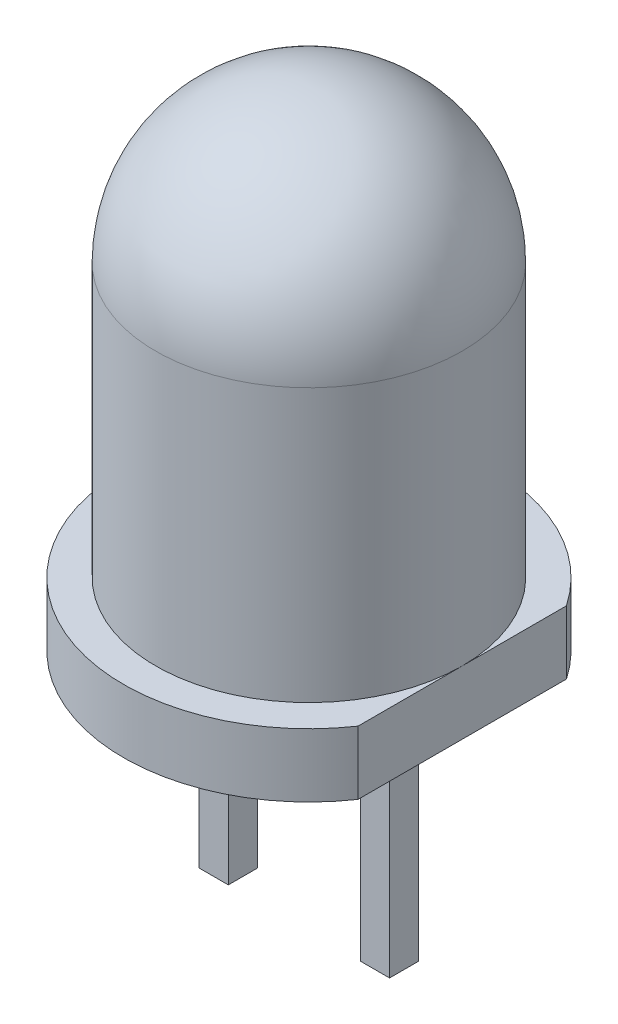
ISO-10303-21;
HEADER;
FILE_DESCRIPTION(('STEP AP214'),'2;1');
FILE_NAME('part.step','',(''),(''),'','','');
FILE_SCHEMA(('AUTOMOTIVE_DESIGN { 1 0 10303 214 1 1 1 1 }'));
ENDSEC;
DATA;
#1=APPLICATION_CONTEXT('core data for automotive mechanical design processes');
#2=APPLICATION_PROTOCOL_DEFINITION('international standard','automotive_design',2000,#1);
#3=PRODUCT_CONTEXT('',#1,'mechanical');
#4=PRODUCT('Part','Part','',(#3));
#5=PRODUCT_RELATED_PRODUCT_CATEGORY('part','',(#4));
#6=PRODUCT_DEFINITION_FORMATION('','',#4);
#7=PRODUCT_DEFINITION_CONTEXT('part definition',#1,'design');
#8=PRODUCT_DEFINITION('design','',#6,#7);
#9=PRODUCT_DEFINITION_SHAPE('','',#8);
#10=(LENGTH_UNIT() NAMED_UNIT(*) SI_UNIT(.MILLI.,.METRE.));
#11=(NAMED_UNIT(*) PLANE_ANGLE_UNIT() SI_UNIT($,.RADIAN.));
#12=(NAMED_UNIT(*) SI_UNIT($,.STERADIAN.) SOLID_ANGLE_UNIT());
#13=UNCERTAINTY_MEASURE_WITH_UNIT(LENGTH_MEASURE(1.E-05),#10,'distance_accuracy_value','');
#14=(GEOMETRIC_REPRESENTATION_CONTEXT(3) GLOBAL_UNCERTAINTY_ASSIGNED_CONTEXT((#13)) GLOBAL_UNIT_ASSIGNED_CONTEXT((#10,
#11,#12)) REPRESENTATION_CONTEXT('',''));
#15=CARTESIAN_POINT('',(0.,0.,0.));
#16=DIRECTION('',(0.,0.,1.));
#17=DIRECTION('',(1.,0.,0.));
#18=AXIS2_PLACEMENT_3D('',#15,#16,#17);
#19=CARTESIAN_POINT('',(0.,0.999999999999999,0.));
#20=DIRECTION('',(0.,1.,0.));
#21=DIRECTION('',(-1.,0.,0.));
#22=AXIS2_PLACEMENT_3D('',#19,#20,#21);
#23=PLANE('',#22);
#24=DIRECTION('',(0.,0.,-1.));
#25=VECTOR('',#24,1.);
#26=CARTESIAN_POINT('',(0.239999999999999,1.,0.23));
#27=LINE('',#26,#25);
#28=CARTESIAN_POINT('',(0.239999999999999,1.,-1.03));
#29=VERTEX_POINT('',#28);
#30=CARTESIAN_POINT('',(0.239999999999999,1.,1.03));
#31=VERTEX_POINT('',#30);
#32=EDGE_CURVE('E197',#29,#31,#27,.F.);
#33=ORIENTED_EDGE('',*,*,#32,.T.);
#34=DIRECTION('',(-1.,0.,0.));
#35=VECTOR('',#34,1.);
#36=CARTESIAN_POINT('',(1.5,1.,1.03));
#37=LINE('',#36,#35);
#38=CARTESIAN_POINT('',(2.3,1.,1.03));
#39=VERTEX_POINT('',#38);
#40=EDGE_CURVE('E206',#31,#39,#37,.F.);
#41=ORIENTED_EDGE('',*,*,#40,.T.);
#42=DIRECTION('',(0.,0.,1.));
#43=VECTOR('',#42,1.);
#44=CARTESIAN_POINT('',(2.3,1.,-0.23));
#45=LINE('',#44,#43);
#46=CARTESIAN_POINT('',(2.3,1.,-1.03));
#47=VERTEX_POINT('',#46);
#48=EDGE_CURVE('E203',#39,#47,#45,.F.);
#49=ORIENTED_EDGE('',*,*,#48,.T.);
#50=DIRECTION('',(1.,0.,0.));
#51=VECTOR('',#50,1.);
#52=CARTESIAN_POINT('',(1.04,1.,-1.03));
#53=LINE('',#52,#51);
#54=EDGE_CURVE('E200',#47,#29,#53,.F.);
#55=ORIENTED_EDGE('',*,*,#54,.T.);
#56=EDGE_LOOP('',(#33,#41,#49,#55));
#57=FACE_BOUND('',#56,.T.);
#58=DIRECTION('',(0.,0.,1.));
#59=VECTOR('',#58,1.);
#60=CARTESIAN_POINT('',(-0.240000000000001,0.999999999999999,-0.23));
#61=LINE('',#60,#59);
#62=CARTESIAN_POINT('',(-0.240000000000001,0.999999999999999,1.03));
#63=VERTEX_POINT('',#62);
#64=CARTESIAN_POINT('',(-0.240000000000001,0.999999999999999,-1.03));
#65=VERTEX_POINT('',#64);
#66=EDGE_CURVE('E184',#63,#65,#61,.F.);
#67=ORIENTED_EDGE('',*,*,#66,.T.);
#68=DIRECTION('',(1.,0.,0.));
#69=VECTOR('',#68,1.);
#70=CARTESIAN_POINT('',(-1.5,0.999999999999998,-1.03));
#71=LINE('',#70,#69);
#72=CARTESIAN_POINT('',(-2.3,0.999999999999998,-1.03));
#73=VERTEX_POINT('',#72);
#74=EDGE_CURVE('E193',#65,#73,#71,.F.);
#75=ORIENTED_EDGE('',*,*,#74,.T.);
#76=DIRECTION('',(0.,0.,-1.));
#77=VECTOR('',#76,1.);
#78=CARTESIAN_POINT('',(-2.3,0.999999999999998,0.23));
#79=LINE('',#78,#77);
#80=CARTESIAN_POINT('',(-2.3,0.999999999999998,1.03));
#81=VERTEX_POINT('',#80);
#82=EDGE_CURVE('E190',#73,#81,#79,.F.);
#83=ORIENTED_EDGE('',*,*,#82,.T.);
#84=DIRECTION('',(-1.,0.,0.));
#85=VECTOR('',#84,1.);
#86=CARTESIAN_POINT('',(-1.04,0.999999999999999,1.03));
#87=LINE('',#86,#85);
#88=EDGE_CURVE('E187',#81,#63,#87,.F.);
#89=ORIENTED_EDGE('',*,*,#88,.T.);
#90=EDGE_LOOP('',(#67,#75,#83,#89));
#91=FACE_BOUND('',#90,.T.);
#92=DIRECTION('',(0.,0.,-1.));
#93=VECTOR('',#92,1.);
#94=CARTESIAN_POINT('',(2.415,1.,0.));
#95=LINE('',#94,#93);
#96=CARTESIAN_POINT('',(2.415,1.,1.64139422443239));
#97=VERTEX_POINT('',#96);
#98=CARTESIAN_POINT('',(2.415,1.,-1.64139422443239));
#99=VERTEX_POINT('',#98);
#100=EDGE_CURVE('E149',#97,#99,#95,.T.);
#101=ORIENTED_EDGE('',*,*,#100,.F.);
#102=CARTESIAN_POINT('',(0.,0.999999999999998,0.));
#103=DIRECTION('',(0.,1.,0.));
#104=DIRECTION('',(-1.,0.,0.));
#105=AXIS2_PLACEMENT_3D('',#102,#103,#104);
#106=CIRCLE('',#105,2.92);
#107=EDGE_CURVE('E170',#99,#97,#106,.T.);
#108=ORIENTED_EDGE('',*,*,#107,.F.);
#109=EDGE_LOOP('',(#101,#108));
#110=FACE_BOUND('',#109,.T.);
#111=ADVANCED_FACE('F37',(#57,#91,#110),#23,.F.);
#112=CARTESIAN_POINT('',(0.,8.71,0.));
#113=DIRECTION('',(0.,1.,0.));
#114=DIRECTION('',(-1.,0.,0.));
#115=AXIS2_PLACEMENT_3D('',#112,#113,#114);
#116=CYLINDRICAL_SURFACE('',#115,2.92);
#117=DIRECTION('',(0.,-1.,0.));
#118=VECTOR('',#117,1.);
#119=CARTESIAN_POINT('',(2.415,5.32140407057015,-1.64139422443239));
#120=LINE('',#119,#118);
#121=CARTESIAN_POINT('',(2.415,2.,-1.64139422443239));
#122=VERTEX_POINT('',#121);
#123=EDGE_CURVE('E143',#122,#99,#120,.T.);
#124=ORIENTED_EDGE('',*,*,#123,.T.);
#125=ORIENTED_EDGE('',*,*,#107,.T.);
#126=DIRECTION('',(0.,-1.,0.));
#127=VECTOR('',#126,1.);
#128=CARTESIAN_POINT('',(2.415,5.32140407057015,1.64139422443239));
#129=LINE('',#128,#127);
#130=CARTESIAN_POINT('',(2.415,2.,1.64139422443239));
#131=VERTEX_POINT('',#130);
#132=EDGE_CURVE('E155',#131,#97,#129,.T.);
#133=ORIENTED_EDGE('',*,*,#132,.F.);
#134=CARTESIAN_POINT('',(0.,2.,0.));
#135=DIRECTION('',(0.,1.,0.));
#136=DIRECTION('',(-1.,0.,0.));
#137=AXIS2_PLACEMENT_3D('',#134,#135,#136);
#138=CIRCLE('',#137,2.92);
#139=EDGE_CURVE('E161',#122,#131,#138,.T.);
#140=ORIENTED_EDGE('',*,*,#139,.F.);
#141=EDGE_LOOP('',(#124,#125,#133,#140));
#142=FACE_BOUND('',#141,.T.);
#143=ADVANCED_FACE('F168',(#142),#116,.T.);
#144=CARTESIAN_POINT('',(2.92,2.,0.));
#145=DIRECTION('',(0.,-1.,0.));
#146=DIRECTION('',(1.,0.,0.));
#147=AXIS2_PLACEMENT_3D('',#144,#145,#146);
#148=PLANE('',#147);
#149=DIRECTION('',(0.,0.,-1.));
#150=VECTOR('',#149,1.);
#151=CARTESIAN_POINT('',(2.415,2.,-1.64139422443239));
#152=LINE('',#151,#150);
#153=CARTESIAN_POINT('',(2.415,2.,0.));
#154=VERTEX_POINT('',#153);
#155=EDGE_CURVE('E146',#154,#122,#152,.T.);
#156=ORIENTED_EDGE('',*,*,#155,.T.);
#157=ORIENTED_EDGE('',*,*,#139,.T.);
#158=EDGE_CURVE('E165',#131,#154,#152,.T.);
#159=ORIENTED_EDGE('',*,*,#158,.T.);
#160=CARTESIAN_POINT('',(0.,2.,0.));
#161=DIRECTION('',(0.,1.,0.));
#162=DIRECTION('',(-1.,0.,0.));
#163=AXIS2_PLACEMENT_3D('',#160,#161,#162);
#164=CIRCLE('',#163,2.415);
#165=EDGE_CURVE('E163',#154,#154,#164,.T.);
#166=ORIENTED_EDGE('',*,*,#165,.F.);
#167=EDGE_LOOP('',(#156,#157,#159,#166));
#168=FACE_BOUND('',#167,.T.);
#169=ADVANCED_FACE('F160',(#168),#148,.F.);
#170=CARTESIAN_POINT('',(0.,8.71,0.));
#171=DIRECTION('',(0.,1.,0.));
#172=DIRECTION('',(-1.,0.,0.));
#173=AXIS2_PLACEMENT_3D('',#170,#171,#172);
#174=CYLINDRICAL_SURFACE('',#173,2.415);
#175=CARTESIAN_POINT('',(0.,6.295,0.));
#176=DIRECTION('',(0.,1.,0.));
#177=DIRECTION('',(-1.,0.,0.));
#178=AXIS2_PLACEMENT_3D('',#175,#176,#177);
#179=CIRCLE('',#178,2.415);
#180=CARTESIAN_POINT('',(-2.415,6.29499999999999,0.));
#181=VERTEX_POINT('',#180);
#182=EDGE_CURVE('E177',#181,#181,#179,.T.);
#183=ORIENTED_EDGE('',*,*,#182,.F.);
#184=EDGE_LOOP('',(#183));
#185=FACE_BOUND('',#184,.T.);
#186=ORIENTED_EDGE('',*,*,#165,.T.);
#187=EDGE_LOOP('',(#186));
#188=FACE_BOUND('',#187,.T.);
#189=ADVANCED_FACE('F297',(#185,#188),#174,.T.);
#190=CARTESIAN_POINT('',(0.,6.295,0.));
#191=DIRECTION('',(0.,1.,0.));
#192=DIRECTION('',(1.,0.,0.));
#193=AXIS2_PLACEMENT_3D('',#190,#191,#192);
#194=SPHERICAL_SURFACE('',#193,2.415);
#195=ORIENTED_EDGE('',*,*,#182,.T.);
#196=EDGE_LOOP('',(#195));
#197=FACE_BOUND('',#196,.T.);
#198=ADVANCED_FACE('F295',(#197),#194,.T.);
#199=CARTESIAN_POINT('',(-1.5,-2.6,0.23));
#200=DIRECTION('',(1.,0.,0.));
#201=DIRECTION('',(0.,1.,0.));
#202=AXIS2_PLACEMENT_3D('',#199,#200,#201);
#203=PLANE('',#202);
#204=DIRECTION('',(0.,1.,0.));
#205=VECTOR('',#204,1.);
#206=CARTESIAN_POINT('',(-1.5,-2.6,0.23));
#207=LINE('',#206,#205);
#208=CARTESIAN_POINT('',(-1.5,-2.6,0.23));
#209=VERTEX_POINT('',#208);
#210=CARTESIAN_POINT('',(-1.5,0.199999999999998,0.23));
#211=VERTEX_POINT('',#210);
#212=EDGE_CURVE('E289',#209,#211,#207,.T.);
#213=ORIENTED_EDGE('',*,*,#212,.T.);
#214=DIRECTION('',(0.,0.,-1.));
#215=VECTOR('',#214,1.);
#216=CARTESIAN_POINT('',(-1.5,0.199999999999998,-0.23));
#217=LINE('',#216,#215);
#218=CARTESIAN_POINT('',(-1.5,0.199999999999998,-0.23));
#219=VERTEX_POINT('',#218);
#220=EDGE_CURVE('E223',#211,#219,#217,.T.);
#221=ORIENTED_EDGE('',*,*,#220,.T.);
#222=DIRECTION('',(0.,1.,0.));
#223=VECTOR('',#222,1.);
#224=CARTESIAN_POINT('',(-1.5,-2.6,-0.23));
#225=LINE('',#224,#223);
#226=CARTESIAN_POINT('',(-1.5,-2.6,-0.23));
#227=VERTEX_POINT('',#226);
#228=EDGE_CURVE('E279',#227,#219,#225,.T.);
#229=ORIENTED_EDGE('',*,*,#228,.F.);
#230=DIRECTION('',(0.,0.,-1.));
#231=VECTOR('',#230,1.);
#232=CARTESIAN_POINT('',(-1.5,-2.6,0.23));
#233=LINE('',#232,#231);
#234=EDGE_CURVE('E539',#209,#227,#233,.T.);
#235=ORIENTED_EDGE('',*,*,#234,.F.);
#236=EDGE_LOOP('',(#213,#221,#229,#235));
#237=FACE_BOUND('',#236,.T.);
#238=ADVANCED_FACE('F305',(#237),#203,.F.);
#239=CARTESIAN_POINT('',(-1.5,-2.6,-0.23));
#240=DIRECTION('',(0.,0.,1.));
#241=DIRECTION('',(1.,0.,0.));
#242=AXIS2_PLACEMENT_3D('',#239,#240,#241);
#243=PLANE('',#242);
#244=ORIENTED_EDGE('',*,*,#228,.T.);
#245=DIRECTION('',(1.,0.,0.));
#246=VECTOR('',#245,1.);
#247=CARTESIAN_POINT('',(-1.04,0.199999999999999,-0.23));
#248=LINE('',#247,#246);
#249=CARTESIAN_POINT('',(-1.04,0.199999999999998,-0.23));
#250=VERTEX_POINT('',#249);
#251=EDGE_CURVE('E219',#219,#250,#248,.T.);
#252=ORIENTED_EDGE('',*,*,#251,.T.);
#253=DIRECTION('',(0.,1.,0.));
#254=VECTOR('',#253,1.);
#255=CARTESIAN_POINT('',(-1.04,-2.6,-0.23));
#256=LINE('',#255,#254);
#257=CARTESIAN_POINT('',(-1.04,-2.6,-0.23));
#258=VERTEX_POINT('',#257);
#259=EDGE_CURVE('E276',#258,#250,#256,.T.);
#260=ORIENTED_EDGE('',*,*,#259,.F.);
#261=DIRECTION('',(1.,0.,0.));
#262=VECTOR('',#261,1.);
#263=CARTESIAN_POINT('',(-1.5,-2.6,-0.23));
#264=LINE('',#263,#262);
#265=EDGE_CURVE('E549',#227,#258,#264,.T.);
#266=ORIENTED_EDGE('',*,*,#265,.F.);
#267=EDGE_LOOP('',(#244,#252,#260,#266));
#268=FACE_BOUND('',#267,.T.);
#269=ADVANCED_FACE('F275',(#268),#243,.F.);
#270=CARTESIAN_POINT('',(-1.04,-2.6,0.23));
#271=DIRECTION('',(-1.,0.,0.));
#272=DIRECTION('',(0.,-1.,0.));
#273=AXIS2_PLACEMENT_3D('',#270,#271,#272);
#274=PLANE('',#273);
#275=ORIENTED_EDGE('',*,*,#259,.T.);
#276=DIRECTION('',(0.,0.,1.));
#277=VECTOR('',#276,1.);
#278=CARTESIAN_POINT('',(-1.04,0.199999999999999,0.23));
#279=LINE('',#278,#277);
#280=CARTESIAN_POINT('',(-1.04,0.199999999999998,0.23));
#281=VERTEX_POINT('',#280);
#282=EDGE_CURVE('E11',#250,#281,#279,.T.);
#283=ORIENTED_EDGE('',*,*,#282,.T.);
#284=DIRECTION('',(0.,1.,0.));
#285=VECTOR('',#284,1.);
#286=CARTESIAN_POINT('',(-1.04,-2.6,0.23));
#287=LINE('',#286,#285);
#288=CARTESIAN_POINT('',(-1.04,-2.6,0.23));
#289=VERTEX_POINT('',#288);
#290=EDGE_CURVE('E283',#289,#281,#287,.T.);
#291=ORIENTED_EDGE('',*,*,#290,.F.);
#292=DIRECTION('',(0.,0.,1.));
#293=VECTOR('',#292,1.);
#294=CARTESIAN_POINT('',(-1.04,-2.6,0.23));
#295=LINE('',#294,#293);
#296=EDGE_CURVE('E281',#258,#289,#295,.T.);
#297=ORIENTED_EDGE('',*,*,#296,.F.);
#298=EDGE_LOOP('',(#275,#283,#291,#297));
#299=FACE_BOUND('',#298,.T.);
#300=ADVANCED_FACE('F280',(#299),#274,.F.);
#301=CARTESIAN_POINT('',(-1.5,-2.6,0.23));
#302=DIRECTION('',(0.,0.,-1.));
#303=DIRECTION('',(-1.,0.,0.));
#304=AXIS2_PLACEMENT_3D('',#301,#302,#303);
#305=PLANE('',#304);
#306=ORIENTED_EDGE('',*,*,#290,.T.);
#307=DIRECTION('',(-1.,0.,0.));
#308=VECTOR('',#307,1.);
#309=CARTESIAN_POINT('',(-1.5,0.199999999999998,0.23));
#310=LINE('',#309,#308);
#311=EDGE_CURVE('E47',#281,#211,#310,.T.);
#312=ORIENTED_EDGE('',*,*,#311,.T.);
#313=ORIENTED_EDGE('',*,*,#212,.F.);
#314=DIRECTION('',(-1.,0.,0.));
#315=VECTOR('',#314,1.);
#316=CARTESIAN_POINT('',(-1.5,-2.6,0.23));
#317=LINE('',#316,#315);
#318=EDGE_CURVE('E542',#289,#209,#317,.T.);
#319=ORIENTED_EDGE('',*,*,#318,.F.);
#320=EDGE_LOOP('',(#306,#312,#313,#319));
#321=FACE_BOUND('',#320,.T.);
#322=ADVANCED_FACE('F399',(#321),#305,.F.);
#323=CARTESIAN_POINT('',(-1.5,-2.6,-0.23));
#324=DIRECTION('',(0.,-1.,0.));
#325=DIRECTION('',(1.,0.,0.));
#326=AXIS2_PLACEMENT_3D('',#323,#324,#325);
#327=PLANE('',#326);
#328=ORIENTED_EDGE('',*,*,#234,.T.);
#329=ORIENTED_EDGE('',*,*,#265,.T.);
#330=ORIENTED_EDGE('',*,*,#296,.T.);
#331=ORIENTED_EDGE('',*,*,#318,.T.);
#332=EDGE_LOOP('',(#328,#329,#330,#331));
#333=FACE_BOUND('',#332,.T.);
#334=ADVANCED_FACE('F392',(#333),#327,.T.);
#335=CARTESIAN_POINT('',(1.5,-2.6,0.23));
#336=DIRECTION('',(0.,0.,-1.));
#337=DIRECTION('',(-1.,0.,0.));
#338=AXIS2_PLACEMENT_3D('',#335,#336,#337);
#339=PLANE('',#338);
#340=DIRECTION('',(0.,1.,0.));
#341=VECTOR('',#340,1.);
#342=CARTESIAN_POINT('',(1.5,-2.6,0.23));
#343=LINE('',#342,#341);
#344=CARTESIAN_POINT('',(1.5,-2.6,0.23));
#345=VERTEX_POINT('',#344);
#346=CARTESIAN_POINT('',(1.5,0.2,0.23));
#347=VERTEX_POINT('',#346);
#348=EDGE_CURVE('E564',#345,#347,#343,.T.);
#349=ORIENTED_EDGE('',*,*,#348,.T.);
#350=DIRECTION('',(-1.,0.,0.));
#351=VECTOR('',#350,1.);
#352=CARTESIAN_POINT('',(1.04,0.2,0.23));
#353=LINE('',#352,#351);
#354=CARTESIAN_POINT('',(1.04,0.2,0.23));
#355=VERTEX_POINT('',#354);
#356=EDGE_CURVE('E174',#347,#355,#353,.T.);
#357=ORIENTED_EDGE('',*,*,#356,.T.);
#358=DIRECTION('',(0.,1.,0.));
#359=VECTOR('',#358,1.);
#360=CARTESIAN_POINT('',(1.04,-2.6,0.23));
#361=LINE('',#360,#359);
#362=CARTESIAN_POINT('',(1.04,-2.6,0.23));
#363=VERTEX_POINT('',#362);
#364=EDGE_CURVE('E553',#363,#355,#361,.T.);
#365=ORIENTED_EDGE('',*,*,#364,.F.);
#366=DIRECTION('',(-1.,0.,0.));
#367=VECTOR('',#366,1.);
#368=CARTESIAN_POINT('',(1.5,-2.6,0.23));
#369=LINE('',#368,#367);
#370=EDGE_CURVE('E576',#345,#363,#369,.T.);
#371=ORIENTED_EDGE('',*,*,#370,.F.);
#372=EDGE_LOOP('',(#349,#357,#365,#371));
#373=FACE_BOUND('',#372,.T.);
#374=ADVANCED_FACE('F385',(#373),#339,.F.);
#375=CARTESIAN_POINT('',(1.04,-2.6,0.23));
#376=DIRECTION('',(1.,0.,0.));
#377=DIRECTION('',(0.,1.,0.));
#378=AXIS2_PLACEMENT_3D('',#375,#376,#377);
#379=PLANE('',#378);
#380=ORIENTED_EDGE('',*,*,#364,.T.);
#381=DIRECTION('',(0.,0.,-1.));
#382=VECTOR('',#381,1.);
#383=CARTESIAN_POINT('',(1.04,0.2,-0.23));
#384=LINE('',#383,#382);
#385=CARTESIAN_POINT('',(1.04,0.2,-0.23));
#386=VERTEX_POINT('',#385);
#387=EDGE_CURVE('E216',#355,#386,#384,.T.);
#388=ORIENTED_EDGE('',*,*,#387,.T.);
#389=DIRECTION('',(0.,1.,0.));
#390=VECTOR('',#389,1.);
#391=CARTESIAN_POINT('',(1.04,-2.6,-0.23));
#392=LINE('',#391,#390);
#393=CARTESIAN_POINT('',(1.04,-2.6,-0.23));
#394=VERTEX_POINT('',#393);
#395=EDGE_CURVE('E557',#394,#386,#392,.T.);
#396=ORIENTED_EDGE('',*,*,#395,.F.);
#397=DIRECTION('',(0.,0.,-1.));
#398=VECTOR('',#397,1.);
#399=CARTESIAN_POINT('',(1.04,-2.6,0.23));
#400=LINE('',#399,#398);
#401=EDGE_CURVE('E573',#363,#394,#400,.T.);
#402=ORIENTED_EDGE('',*,*,#401,.F.);
#403=EDGE_LOOP('',(#380,#388,#396,#402));
#404=FACE_BOUND('',#403,.T.);
#405=ADVANCED_FACE('F378',(#404),#379,.F.);
#406=CARTESIAN_POINT('',(1.5,-2.6,-0.23));
#407=DIRECTION('',(0.,0.,1.));
#408=DIRECTION('',(1.,0.,0.));
#409=AXIS2_PLACEMENT_3D('',#406,#407,#408);
#410=PLANE('',#409);
#411=ORIENTED_EDGE('',*,*,#395,.T.);
#412=DIRECTION('',(1.,0.,0.));
#413=VECTOR('',#412,1.);
#414=CARTESIAN_POINT('',(1.5,0.2,-0.23));
#415=LINE('',#414,#413);
#416=CARTESIAN_POINT('',(1.5,0.2,-0.23));
#417=VERTEX_POINT('',#416);
#418=EDGE_CURVE('E213',#386,#417,#415,.T.);
#419=ORIENTED_EDGE('',*,*,#418,.T.);
#420=DIRECTION('',(0.,1.,0.));
#421=VECTOR('',#420,1.);
#422=CARTESIAN_POINT('',(1.5,-2.6,-0.23));
#423=LINE('',#422,#421);
#424=CARTESIAN_POINT('',(1.5,-2.6,-0.23));
#425=VERTEX_POINT('',#424);
#426=EDGE_CURVE('E560',#425,#417,#423,.T.);
#427=ORIENTED_EDGE('',*,*,#426,.F.);
#428=DIRECTION('',(1.,0.,0.));
#429=VECTOR('',#428,1.);
#430=CARTESIAN_POINT('',(1.5,-2.6,-0.23));
#431=LINE('',#430,#429);
#432=EDGE_CURVE('E570',#394,#425,#431,.T.);
#433=ORIENTED_EDGE('',*,*,#432,.F.);
#434=EDGE_LOOP('',(#411,#419,#427,#433));
#435=FACE_BOUND('',#434,.T.);
#436=ADVANCED_FACE('F371',(#435),#410,.F.);
#437=CARTESIAN_POINT('',(1.5,-2.6,0.23));
#438=DIRECTION('',(-1.,0.,0.));
#439=DIRECTION('',(0.,-1.,0.));
#440=AXIS2_PLACEMENT_3D('',#437,#438,#439);
#441=PLANE('',#440);
#442=ORIENTED_EDGE('',*,*,#426,.T.);
#443=DIRECTION('',(0.,0.,1.));
#444=VECTOR('',#443,1.);
#445=CARTESIAN_POINT('',(1.5,0.2,0.23));
#446=LINE('',#445,#444);
#447=EDGE_CURVE('E210',#417,#347,#446,.T.);
#448=ORIENTED_EDGE('',*,*,#447,.T.);
#449=ORIENTED_EDGE('',*,*,#348,.F.);
#450=DIRECTION('',(0.,0.,1.));
#451=VECTOR('',#450,1.);
#452=CARTESIAN_POINT('',(1.5,-2.6,0.23));
#453=LINE('',#452,#451);
#454=EDGE_CURVE('E567',#425,#345,#453,.T.);
#455=ORIENTED_EDGE('',*,*,#454,.F.);
#456=EDGE_LOOP('',(#442,#448,#449,#455));
#457=FACE_BOUND('',#456,.T.);
#458=ADVANCED_FACE('F364',(#457),#441,.F.);
#459=CARTESIAN_POINT('',(1.04,-2.6,0.23));
#460=DIRECTION('',(0.,-1.,0.));
#461=DIRECTION('',(1.,0.,0.));
#462=AXIS2_PLACEMENT_3D('',#459,#460,#461);
#463=PLANE('',#462);
#464=ORIENTED_EDGE('',*,*,#370,.T.);
#465=ORIENTED_EDGE('',*,*,#401,.T.);
#466=ORIENTED_EDGE('',*,*,#432,.T.);
#467=ORIENTED_EDGE('',*,*,#454,.T.);
#468=EDGE_LOOP('',(#464,#465,#466,#467));
#469=FACE_BOUND('',#468,.T.);
#470=ADVANCED_FACE('F358',(#469),#463,.T.);
#471=CARTESIAN_POINT('',(2.415,5.32140407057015,-1.64139422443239));
#472=DIRECTION('',(1.,0.,0.));
#473=DIRECTION('',(0.,0.,-1.));
#474=AXIS2_PLACEMENT_3D('',#471,#472,#473);
#475=PLANE('',#474);
#476=ORIENTED_EDGE('',*,*,#100,.T.);
#477=ORIENTED_EDGE('',*,*,#123,.F.);
#478=ORIENTED_EDGE('',*,*,#155,.F.);
#479=ORIENTED_EDGE('',*,*,#158,.F.);
#480=ORIENTED_EDGE('',*,*,#132,.T.);
#481=EDGE_LOOP('',(#476,#477,#478,#479,#480));
#482=FACE_BOUND('',#481,.T.);
#483=ADVANCED_FACE('F145',(#482),#475,.T.);
#484=CARTESIAN_POINT('',(1.5,0.2,-1.03));
#485=DIRECTION('',(-1.,0.,0.));
#486=DIRECTION('',(0.,-1.,0.));
#487=AXIS2_PLACEMENT_3D('',#484,#485,#486);
#488=CYLINDRICAL_SURFACE('',#487,0.8);
#489=CARTESIAN_POINT('',(0.24,0.199999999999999,-1.03));
#490=DIRECTION('',(-0.707106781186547,0.,0.707106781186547));
#491=DIRECTION('',(0.707106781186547,0.,0.707106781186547));
#492=AXIS2_PLACEMENT_3D('',#489,#490,#491);
#493=ELLIPSE('',#492,1.13137084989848,0.8);
#494=EDGE_CURVE('E234',#29,#386,#493,.F.);
#495=ORIENTED_EDGE('',*,*,#494,.F.);
#496=ORIENTED_EDGE('',*,*,#54,.F.);
#497=CARTESIAN_POINT('',(2.3,0.200000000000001,-1.03));
#498=DIRECTION('',(-0.707106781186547,0.,-0.707106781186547));
#499=DIRECTION('',(-0.707106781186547,0.,0.707106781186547));
#500=AXIS2_PLACEMENT_3D('',#497,#498,#499);
#501=ELLIPSE('',#500,1.13137084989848,0.8);
#502=EDGE_CURVE('E238',#417,#47,#501,.T.);
#503=ORIENTED_EDGE('',*,*,#502,.F.);
#504=ORIENTED_EDGE('',*,*,#418,.F.);
#505=EDGE_LOOP('',(#495,#496,#503,#504));
#506=FACE_BOUND('',#505,.T.);
#507=ADVANCED_FACE('F327',(#506),#488,.F.);
#508=CARTESIAN_POINT('',(2.3,0.200000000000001,0.23));
#509=DIRECTION('',(0.,0.,-1.));
#510=DIRECTION('',(-1.,0.,0.));
#511=AXIS2_PLACEMENT_3D('',#508,#509,#510);
#512=CYLINDRICAL_SURFACE('',#511,0.8);
#513=ORIENTED_EDGE('',*,*,#502,.T.);
#514=ORIENTED_EDGE('',*,*,#48,.F.);
#515=CARTESIAN_POINT('',(2.3,0.200000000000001,1.03));
#516=DIRECTION('',(0.707106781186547,0.,-0.707106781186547));
#517=DIRECTION('',(-0.707106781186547,0.,-0.707106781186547));
#518=AXIS2_PLACEMENT_3D('',#515,#516,#517);
#519=ELLIPSE('',#518,1.13137084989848,0.8);
#520=EDGE_CURVE('E231',#347,#39,#519,.T.);
#521=ORIENTED_EDGE('',*,*,#520,.F.);
#522=ORIENTED_EDGE('',*,*,#447,.F.);
#523=EDGE_LOOP('',(#513,#514,#521,#522));
#524=FACE_BOUND('',#523,.T.);
#525=ADVANCED_FACE('F323',(#524),#512,.F.);
#526=CARTESIAN_POINT('',(0.24,0.199999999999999,0.23));
#527=DIRECTION('',(0.,0.,1.));
#528=DIRECTION('',(1.,0.,0.));
#529=AXIS2_PLACEMENT_3D('',#526,#527,#528);
#530=CYLINDRICAL_SURFACE('',#529,0.8);
#531=ORIENTED_EDGE('',*,*,#494,.T.);
#532=ORIENTED_EDGE('',*,*,#387,.F.);
#533=CARTESIAN_POINT('',(0.24,0.199999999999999,1.03));
#534=DIRECTION('',(0.707106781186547,0.,0.707106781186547));
#535=DIRECTION('',(-0.707106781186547,0.,0.707106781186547));
#536=AXIS2_PLACEMENT_3D('',#533,#534,#535);
#537=ELLIPSE('',#536,1.13137084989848,0.8);
#538=EDGE_CURVE('E228',#31,#355,#537,.F.);
#539=ORIENTED_EDGE('',*,*,#538,.F.);
#540=ORIENTED_EDGE('',*,*,#32,.F.);
#541=EDGE_LOOP('',(#531,#532,#539,#540));
#542=FACE_BOUND('',#541,.T.);
#543=ADVANCED_FACE('F319',(#542),#530,.F.);
#544=CARTESIAN_POINT('',(1.5,0.2,1.03));
#545=DIRECTION('',(1.,0.,0.));
#546=DIRECTION('',(0.,1.,0.));
#547=AXIS2_PLACEMENT_3D('',#544,#545,#546);
#548=CYLINDRICAL_SURFACE('',#547,0.8);
#549=ORIENTED_EDGE('',*,*,#520,.T.);
#550=ORIENTED_EDGE('',*,*,#40,.F.);
#551=ORIENTED_EDGE('',*,*,#538,.T.);
#552=ORIENTED_EDGE('',*,*,#356,.F.);
#553=EDGE_LOOP('',(#549,#550,#551,#552));
#554=FACE_BOUND('',#553,.T.);
#555=ADVANCED_FACE('F316',(#554),#548,.F.);
#556=CARTESIAN_POINT('',(-1.5,0.199999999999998,1.03));
#557=DIRECTION('',(1.,0.,0.));
#558=DIRECTION('',(0.,1.,0.));
#559=AXIS2_PLACEMENT_3D('',#556,#557,#558);
#560=CYLINDRICAL_SURFACE('',#559,0.8);
#561=CARTESIAN_POINT('',(-0.24,0.199999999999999,1.03));
#562=DIRECTION('',(0.707106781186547,0.,-0.707106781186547));
#563=DIRECTION('',(-0.707106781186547,0.,-0.707106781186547));
#564=AXIS2_PLACEMENT_3D('',#561,#562,#563);
#565=ELLIPSE('',#564,1.13137084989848,0.8);
#566=EDGE_CURVE('E247',#63,#281,#565,.F.);
#567=ORIENTED_EDGE('',*,*,#566,.F.);
#568=ORIENTED_EDGE('',*,*,#88,.F.);
#569=CARTESIAN_POINT('',(-2.3,0.199999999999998,1.03));
#570=DIRECTION('',(0.707106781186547,0.,0.707106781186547));
#571=DIRECTION('',(0.707106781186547,0.,-0.707106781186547));
#572=AXIS2_PLACEMENT_3D('',#569,#570,#571);
#573=ELLIPSE('',#572,1.13137084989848,0.8);
#574=EDGE_CURVE('E41',#211,#81,#573,.T.);
#575=ORIENTED_EDGE('',*,*,#574,.F.);
#576=ORIENTED_EDGE('',*,*,#311,.F.);
#577=EDGE_LOOP('',(#567,#568,#575,#576));
#578=FACE_BOUND('',#577,.T.);
#579=ADVANCED_FACE('F39',(#578),#560,.F.);
#580=CARTESIAN_POINT('',(-2.3,0.199999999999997,0.23));
#581=DIRECTION('',(0.,0.,1.));
#582=DIRECTION('',(1.,0.,0.));
#583=AXIS2_PLACEMENT_3D('',#580,#581,#582);
#584=CYLINDRICAL_SURFACE('',#583,0.8);
#585=ORIENTED_EDGE('',*,*,#574,.T.);
#586=ORIENTED_EDGE('',*,*,#82,.F.);
#587=CARTESIAN_POINT('',(-2.3,0.199999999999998,-1.03));
#588=DIRECTION('',(-0.707106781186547,0.,0.707106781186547));
#589=DIRECTION('',(0.707106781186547,0.,0.707106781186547));
#590=AXIS2_PLACEMENT_3D('',#587,#588,#589);
#591=ELLIPSE('',#590,1.13137084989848,0.8);
#592=EDGE_CURVE('E245',#219,#73,#591,.T.);
#593=ORIENTED_EDGE('',*,*,#592,.F.);
#594=ORIENTED_EDGE('',*,*,#220,.F.);
#595=EDGE_LOOP('',(#585,#586,#593,#594));
#596=FACE_BOUND('',#595,.T.);
#597=ADVANCED_FACE('F260',(#596),#584,.F.);
#598=CARTESIAN_POINT('',(-0.24,0.199999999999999,0.23));
#599=DIRECTION('',(0.,0.,-1.));
#600=DIRECTION('',(-1.,0.,0.));
#601=AXIS2_PLACEMENT_3D('',#598,#599,#600);
#602=CYLINDRICAL_SURFACE('',#601,0.8);
#603=ORIENTED_EDGE('',*,*,#566,.T.);
#604=ORIENTED_EDGE('',*,*,#282,.F.);
#605=CARTESIAN_POINT('',(-0.24,0.199999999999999,-1.03));
#606=DIRECTION('',(-0.707106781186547,0.,-0.707106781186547));
#607=DIRECTION('',(0.707106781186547,0.,-0.707106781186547));
#608=AXIS2_PLACEMENT_3D('',#605,#606,#607);
#609=ELLIPSE('',#608,1.13137084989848,0.8);
#610=EDGE_CURVE('E242',#65,#250,#609,.F.);
#611=ORIENTED_EDGE('',*,*,#610,.F.);
#612=ORIENTED_EDGE('',*,*,#66,.F.);
#613=EDGE_LOOP('',(#603,#604,#611,#612));
#614=FACE_BOUND('',#613,.T.);
#615=ADVANCED_FACE('F271',(#614),#602,.F.);
#616=CARTESIAN_POINT('',(-1.5,0.199999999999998,-1.03));
#617=DIRECTION('',(-1.,0.,0.));
#618=DIRECTION('',(0.,-1.,0.));
#619=AXIS2_PLACEMENT_3D('',#616,#617,#618);
#620=CYLINDRICAL_SURFACE('',#619,0.8);
#621=ORIENTED_EDGE('',*,*,#592,.T.);
#622=ORIENTED_EDGE('',*,*,#74,.F.);
#623=ORIENTED_EDGE('',*,*,#610,.T.);
#624=ORIENTED_EDGE('',*,*,#251,.F.);
#625=EDGE_LOOP('',(#621,#622,#623,#624));
#626=FACE_BOUND('',#625,.T.);
#627=ADVANCED_FACE('F269',(#626),#620,.F.);
#628=CLOSED_SHELL('',(#111,#143,#169,#189,#198,#238,#269,#300,#322,#334,#374,#405,#436,#458,
#470,#483,#507,#525,#543,#555,#579,#597,#615,#627));
#629=MANIFOLD_SOLID_BREP('B2',#628);
#630=ADVANCED_BREP_SHAPE_REPRESENTATION('',(#18,#629),#14);
#631=SHAPE_DEFINITION_REPRESENTATION(#9,#630);
ENDSEC;
END-ISO-10303-21;
